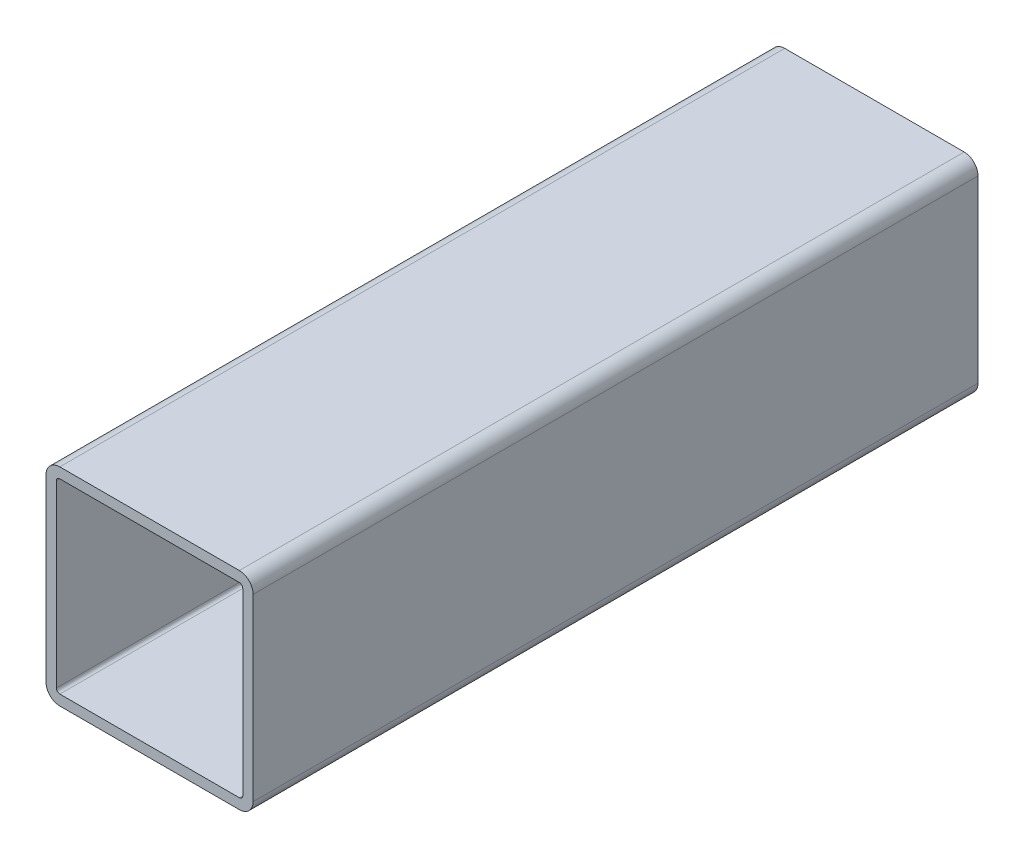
ISO-10303-21;
HEADER;
FILE_DESCRIPTION(('STEP AP214'),'2;1');
FILE_NAME('part.step','',(''),(''),'','','');
FILE_SCHEMA(('AUTOMOTIVE_DESIGN { 1 0 10303 214 1 1 1 1 }'));
ENDSEC;
DATA;
#1=APPLICATION_CONTEXT('core data for automotive mechanical design processes');
#2=APPLICATION_PROTOCOL_DEFINITION('international standard','automotive_design',2000,#1);
#3=PRODUCT_CONTEXT('',#1,'mechanical');
#4=PRODUCT('Part','Part','',(#3));
#5=PRODUCT_RELATED_PRODUCT_CATEGORY('part','',(#4));
#6=PRODUCT_DEFINITION_FORMATION('','',#4);
#7=PRODUCT_DEFINITION_CONTEXT('part definition',#1,'design');
#8=PRODUCT_DEFINITION('design','',#6,#7);
#9=PRODUCT_DEFINITION_SHAPE('','',#8);
#10=(LENGTH_UNIT() NAMED_UNIT(*) SI_UNIT(.MILLI.,.METRE.));
#11=(NAMED_UNIT(*) PLANE_ANGLE_UNIT() SI_UNIT($,.RADIAN.));
#12=(NAMED_UNIT(*) SI_UNIT($,.STERADIAN.) SOLID_ANGLE_UNIT());
#13=UNCERTAINTY_MEASURE_WITH_UNIT(LENGTH_MEASURE(1.E-05),#10,'distance_accuracy_value','');
#14=(GEOMETRIC_REPRESENTATION_CONTEXT(3) GLOBAL_UNCERTAINTY_ASSIGNED_CONTEXT((#13)) GLOBAL_UNIT_ASSIGNED_CONTEXT((#10,
#11,#12)) REPRESENTATION_CONTEXT('',''));
#15=CARTESIAN_POINT('',(0.,0.,0.));
#16=DIRECTION('',(0.,0.,1.));
#17=DIRECTION('',(1.,0.,0.));
#18=AXIS2_PLACEMENT_3D('',#15,#16,#17);
#19=CARTESIAN_POINT('',(56.,-56.,210.));
#20=DIRECTION('',(0.,0.,-1.));
#21=DIRECTION('',(-1.,0.,0.));
#22=AXIS2_PLACEMENT_3D('',#19,#20,#21);
#23=PLANE('',#22);
#24=CARTESIAN_POINT('',(56.,-56.,210.));
#25=DIRECTION('',(0.,0.,1.));
#26=DIRECTION('',(-1.,0.,0.));
#27=AXIS2_PLACEMENT_3D('',#24,#25,#26);
#28=CIRCLE('',#27,4.);
#29=CARTESIAN_POINT('',(56.,-60.,210.));
#30=VERTEX_POINT('',#29);
#31=CARTESIAN_POINT('',(60.,-56.,210.));
#32=VERTEX_POINT('',#31);
#33=EDGE_CURVE('E222',#30,#32,#28,.T.);
#34=ORIENTED_EDGE('',*,*,#33,.T.);
#35=DIRECTION('',(0.,1.,0.));
#36=VECTOR('',#35,1.);
#37=CARTESIAN_POINT('',(60.,-4.00000000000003,210.));
#38=LINE('',#37,#36);
#39=CARTESIAN_POINT('',(60.,-4.00000000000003,210.));
#40=VERTEX_POINT('',#39);
#41=EDGE_CURVE('E225',#32,#40,#38,.T.);
#42=ORIENTED_EDGE('',*,*,#41,.T.);
#43=CARTESIAN_POINT('',(56.,-4.,210.));
#44=DIRECTION('',(0.,0.,1.));
#45=DIRECTION('',(-1.,0.,0.));
#46=AXIS2_PLACEMENT_3D('',#43,#44,#45);
#47=CIRCLE('',#46,4.);
#48=CARTESIAN_POINT('',(56.,0.,210.));
#49=VERTEX_POINT('',#48);
#50=EDGE_CURVE('E227',#40,#49,#47,.T.);
#51=ORIENTED_EDGE('',*,*,#50,.T.);
#52=DIRECTION('',(-1.,0.,0.));
#53=VECTOR('',#52,1.);
#54=CARTESIAN_POINT('',(4.00000000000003,0.,210.));
#55=LINE('',#54,#53);
#56=CARTESIAN_POINT('',(4.00000000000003,0.,210.));
#57=VERTEX_POINT('',#56);
#58=EDGE_CURVE('E229',#49,#57,#55,.T.);
#59=ORIENTED_EDGE('',*,*,#58,.T.);
#60=CARTESIAN_POINT('',(4.,-4.,210.));
#61=DIRECTION('',(0.,0.,1.));
#62=DIRECTION('',(-1.,0.,0.));
#63=AXIS2_PLACEMENT_3D('',#60,#61,#62);
#64=CIRCLE('',#63,4.);
#65=CARTESIAN_POINT('',(0.,-4.00000000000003,210.));
#66=VERTEX_POINT('',#65);
#67=EDGE_CURVE('E231',#57,#66,#64,.T.);
#68=ORIENTED_EDGE('',*,*,#67,.T.);
#69=DIRECTION('',(0.,-1.,0.));
#70=VECTOR('',#69,1.);
#71=CARTESIAN_POINT('',(0.,-4.00000000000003,210.));
#72=LINE('',#71,#70);
#73=CARTESIAN_POINT('',(0.,-56.,210.));
#74=VERTEX_POINT('',#73);
#75=EDGE_CURVE('E233',#66,#74,#72,.T.);
#76=ORIENTED_EDGE('',*,*,#75,.T.);
#77=CARTESIAN_POINT('',(4.00000000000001,-56.,210.));
#78=DIRECTION('',(0.,0.,1.));
#79=DIRECTION('',(-1.,0.,0.));
#80=AXIS2_PLACEMENT_3D('',#77,#78,#79);
#81=CIRCLE('',#80,4.);
#82=CARTESIAN_POINT('',(4.00000000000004,-60.,210.));
#83=VERTEX_POINT('',#82);
#84=EDGE_CURVE('E235',#74,#83,#81,.T.);
#85=ORIENTED_EDGE('',*,*,#84,.T.);
#86=DIRECTION('',(1.,0.,0.));
#87=VECTOR('',#86,1.);
#88=CARTESIAN_POINT('',(4.00000000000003,-60.,210.));
#89=LINE('',#88,#87);
#90=EDGE_CURVE('E237',#83,#30,#89,.T.);
#91=ORIENTED_EDGE('',*,*,#90,.T.);
#92=EDGE_LOOP('',(#34,#42,#51,#59,#68,#76,#85,#91));
#93=FACE_BOUND('',#92,.T.);
#94=CARTESIAN_POINT('',(4.,-4.,210.));
#95=DIRECTION('',(0.,0.,1.));
#96=DIRECTION('',(-1.,0.,0.));
#97=AXIS2_PLACEMENT_3D('',#94,#95,#96);
#98=CIRCLE('',#97,0.999999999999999);
#99=CARTESIAN_POINT('',(4.00000000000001,-3.,210.));
#100=VERTEX_POINT('',#99);
#101=CARTESIAN_POINT('',(3.,-4.00000000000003,210.));
#102=VERTEX_POINT('',#101);
#103=EDGE_CURVE('E157',#100,#102,#98,.T.);
#104=ORIENTED_EDGE('',*,*,#103,.F.);
#105=DIRECTION('',(-1.,0.,0.));
#106=VECTOR('',#105,1.);
#107=CARTESIAN_POINT('',(4.00000000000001,-3.,210.));
#108=LINE('',#107,#106);
#109=CARTESIAN_POINT('',(56.,-3.,210.));
#110=VERTEX_POINT('',#109);
#111=EDGE_CURVE('E192',#110,#100,#108,.T.);
#112=ORIENTED_EDGE('',*,*,#111,.F.);
#113=CARTESIAN_POINT('',(56.,-4.,210.));
#114=DIRECTION('',(0.,0.,1.));
#115=DIRECTION('',(-1.,0.,0.));
#116=AXIS2_PLACEMENT_3D('',#113,#114,#115);
#117=CIRCLE('',#116,1.);
#118=CARTESIAN_POINT('',(57.,-4.00000000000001,210.));
#119=VERTEX_POINT('',#118);
#120=EDGE_CURVE('E190',#119,#110,#117,.T.);
#121=ORIENTED_EDGE('',*,*,#120,.F.);
#122=DIRECTION('',(0.,1.,0.));
#123=VECTOR('',#122,1.);
#124=CARTESIAN_POINT('',(57.,-4.00000000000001,210.));
#125=LINE('',#124,#123);
#126=CARTESIAN_POINT('',(57.,-56.,210.));
#127=VERTEX_POINT('',#126);
#128=EDGE_CURVE('E188',#127,#119,#125,.T.);
#129=ORIENTED_EDGE('',*,*,#128,.F.);
#130=CARTESIAN_POINT('',(56.,-56.,210.));
#131=DIRECTION('',(0.,0.,1.));
#132=DIRECTION('',(-1.,0.,0.));
#133=AXIS2_PLACEMENT_3D('',#130,#131,#132);
#134=CIRCLE('',#133,1.);
#135=CARTESIAN_POINT('',(56.,-57.,210.));
#136=VERTEX_POINT('',#135);
#137=EDGE_CURVE('E186',#136,#127,#134,.T.);
#138=ORIENTED_EDGE('',*,*,#137,.F.);
#139=DIRECTION('',(1.,0.,0.));
#140=VECTOR('',#139,1.);
#141=CARTESIAN_POINT('',(4.00000000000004,-57.,210.));
#142=LINE('',#141,#140);
#143=CARTESIAN_POINT('',(4.00000000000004,-57.,210.));
#144=VERTEX_POINT('',#143);
#145=EDGE_CURVE('E184',#144,#136,#142,.T.);
#146=ORIENTED_EDGE('',*,*,#145,.F.);
#147=CARTESIAN_POINT('',(4.00000000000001,-56.,210.));
#148=DIRECTION('',(0.,0.,1.));
#149=DIRECTION('',(-1.,0.,0.));
#150=AXIS2_PLACEMENT_3D('',#147,#148,#149);
#151=CIRCLE('',#150,1.);
#152=CARTESIAN_POINT('',(3.00000000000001,-56.,210.));
#153=VERTEX_POINT('',#152);
#154=EDGE_CURVE('E182',#153,#144,#151,.T.);
#155=ORIENTED_EDGE('',*,*,#154,.F.);
#156=DIRECTION('',(0.,-1.,0.));
#157=VECTOR('',#156,1.);
#158=CARTESIAN_POINT('',(3.,-4.00000000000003,210.));
#159=LINE('',#158,#157);
#160=EDGE_CURVE('E180',#102,#153,#159,.T.);
#161=ORIENTED_EDGE('',*,*,#160,.F.);
#162=EDGE_LOOP('',(#104,#112,#121,#129,#138,#146,#155,#161));
#163=FACE_BOUND('',#162,.T.);
#164=ADVANCED_FACE('F29',(#93,#163),#23,.F.);
#165=CARTESIAN_POINT('',(56.,-56.,0.));
#166=DIRECTION('',(0.,0.,-1.));
#167=DIRECTION('',(-1.,0.,0.));
#168=AXIS2_PLACEMENT_3D('',#165,#166,#167);
#169=PLANE('',#168);
#170=CARTESIAN_POINT('',(56.,-56.,0.));
#171=DIRECTION('',(0.,0.,1.));
#172=DIRECTION('',(-1.,0.,0.));
#173=AXIS2_PLACEMENT_3D('',#170,#171,#172);
#174=CIRCLE('',#173,4.);
#175=CARTESIAN_POINT('',(56.,-60.,0.));
#176=VERTEX_POINT('',#175);
#177=CARTESIAN_POINT('',(60.,-56.,0.));
#178=VERTEX_POINT('',#177);
#179=EDGE_CURVE('E158',#176,#178,#174,.T.);
#180=ORIENTED_EDGE('',*,*,#179,.F.);
#181=DIRECTION('',(1.,0.,0.));
#182=VECTOR('',#181,1.);
#183=CARTESIAN_POINT('',(4.00000000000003,-60.,0.));
#184=LINE('',#183,#182);
#185=CARTESIAN_POINT('',(4.00000000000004,-60.,0.));
#186=VERTEX_POINT('',#185);
#187=EDGE_CURVE('E220',#186,#176,#184,.T.);
#188=ORIENTED_EDGE('',*,*,#187,.F.);
#189=CARTESIAN_POINT('',(4.00000000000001,-56.,0.));
#190=DIRECTION('',(0.,0.,1.));
#191=DIRECTION('',(-1.,0.,0.));
#192=AXIS2_PLACEMENT_3D('',#189,#190,#191);
#193=CIRCLE('',#192,4.);
#194=CARTESIAN_POINT('',(0.,-56.,0.));
#195=VERTEX_POINT('',#194);
#196=EDGE_CURVE('E218',#195,#186,#193,.T.);
#197=ORIENTED_EDGE('',*,*,#196,.F.);
#198=DIRECTION('',(0.,-1.,0.));
#199=VECTOR('',#198,1.);
#200=CARTESIAN_POINT('',(0.,-4.00000000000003,0.));
#201=LINE('',#200,#199);
#202=CARTESIAN_POINT('',(0.,-4.00000000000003,0.));
#203=VERTEX_POINT('',#202);
#204=EDGE_CURVE('E216',#203,#195,#201,.T.);
#205=ORIENTED_EDGE('',*,*,#204,.F.);
#206=CARTESIAN_POINT('',(4.,-4.,0.));
#207=DIRECTION('',(0.,0.,1.));
#208=DIRECTION('',(-1.,0.,0.));
#209=AXIS2_PLACEMENT_3D('',#206,#207,#208);
#210=CIRCLE('',#209,4.);
#211=CARTESIAN_POINT('',(4.00000000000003,0.,0.));
#212=VERTEX_POINT('',#211);
#213=EDGE_CURVE('E214',#212,#203,#210,.T.);
#214=ORIENTED_EDGE('',*,*,#213,.F.);
#215=DIRECTION('',(-1.,0.,0.));
#216=VECTOR('',#215,1.);
#217=CARTESIAN_POINT('',(4.00000000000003,0.,0.));
#218=LINE('',#217,#216);
#219=CARTESIAN_POINT('',(56.,0.,0.));
#220=VERTEX_POINT('',#219);
#221=EDGE_CURVE('E212',#220,#212,#218,.T.);
#222=ORIENTED_EDGE('',*,*,#221,.F.);
#223=CARTESIAN_POINT('',(56.,-4.,0.));
#224=DIRECTION('',(0.,0.,1.));
#225=DIRECTION('',(-1.,0.,0.));
#226=AXIS2_PLACEMENT_3D('',#223,#224,#225);
#227=CIRCLE('',#226,4.);
#228=CARTESIAN_POINT('',(60.,-4.00000000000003,0.));
#229=VERTEX_POINT('',#228);
#230=EDGE_CURVE('E210',#229,#220,#227,.T.);
#231=ORIENTED_EDGE('',*,*,#230,.F.);
#232=DIRECTION('',(0.,1.,0.));
#233=VECTOR('',#232,1.);
#234=CARTESIAN_POINT('',(60.,-4.00000000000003,0.));
#235=LINE('',#234,#233);
#236=EDGE_CURVE('E208',#178,#229,#235,.T.);
#237=ORIENTED_EDGE('',*,*,#236,.F.);
#238=EDGE_LOOP('',(#180,#188,#197,#205,#214,#222,#231,#237));
#239=FACE_BOUND('',#238,.T.);
#240=DIRECTION('',(-1.,0.,0.));
#241=VECTOR('',#240,1.);
#242=CARTESIAN_POINT('',(4.00000000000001,-3.,0.));
#243=LINE('',#242,#241);
#244=CARTESIAN_POINT('',(56.,-3.,0.));
#245=VERTEX_POINT('',#244);
#246=CARTESIAN_POINT('',(4.00000000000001,-3.,0.));
#247=VERTEX_POINT('',#246);
#248=EDGE_CURVE('E163',#245,#247,#243,.T.);
#249=ORIENTED_EDGE('',*,*,#248,.T.);
#250=CARTESIAN_POINT('',(4.,-4.,0.));
#251=DIRECTION('',(0.,0.,1.));
#252=DIRECTION('',(-1.,0.,0.));
#253=AXIS2_PLACEMENT_3D('',#250,#251,#252);
#254=CIRCLE('',#253,0.999999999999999);
#255=CARTESIAN_POINT('',(3.,-4.00000000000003,0.));
#256=VERTEX_POINT('',#255);
#257=EDGE_CURVE('E52',#247,#256,#254,.T.);
#258=ORIENTED_EDGE('',*,*,#257,.T.);
#259=DIRECTION('',(0.,-1.,0.));
#260=VECTOR('',#259,1.);
#261=CARTESIAN_POINT('',(3.,-4.00000000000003,0.));
#262=LINE('',#261,#260);
#263=CARTESIAN_POINT('',(3.00000000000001,-56.,0.));
#264=VERTEX_POINT('',#263);
#265=EDGE_CURVE('E144',#256,#264,#262,.T.);
#266=ORIENTED_EDGE('',*,*,#265,.T.);
#267=CARTESIAN_POINT('',(4.00000000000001,-56.,0.));
#268=DIRECTION('',(0.,0.,1.));
#269=DIRECTION('',(-1.,0.,0.));
#270=AXIS2_PLACEMENT_3D('',#267,#268,#269);
#271=CIRCLE('',#270,1.);
#272=CARTESIAN_POINT('',(4.00000000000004,-57.,0.));
#273=VERTEX_POINT('',#272);
#274=EDGE_CURVE('E153',#264,#273,#271,.T.);
#275=ORIENTED_EDGE('',*,*,#274,.T.);
#276=DIRECTION('',(1.,0.,0.));
#277=VECTOR('',#276,1.);
#278=CARTESIAN_POINT('',(4.00000000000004,-57.,0.));
#279=LINE('',#278,#277);
#280=CARTESIAN_POINT('',(56.,-57.,0.));
#281=VERTEX_POINT('',#280);
#282=EDGE_CURVE('E167',#273,#281,#279,.T.);
#283=ORIENTED_EDGE('',*,*,#282,.T.);
#284=CARTESIAN_POINT('',(56.,-56.,0.));
#285=DIRECTION('',(0.,0.,1.));
#286=DIRECTION('',(-1.,0.,0.));
#287=AXIS2_PLACEMENT_3D('',#284,#285,#286);
#288=CIRCLE('',#287,1.);
#289=CARTESIAN_POINT('',(57.,-56.,0.));
#290=VERTEX_POINT('',#289);
#291=EDGE_CURVE('E170',#281,#290,#288,.T.);
#292=ORIENTED_EDGE('',*,*,#291,.T.);
#293=DIRECTION('',(0.,1.,0.));
#294=VECTOR('',#293,1.);
#295=CARTESIAN_POINT('',(57.,-4.00000000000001,0.));
#296=LINE('',#295,#294);
#297=CARTESIAN_POINT('',(57.,-4.00000000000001,0.));
#298=VERTEX_POINT('',#297);
#299=EDGE_CURVE('E173',#290,#298,#296,.T.);
#300=ORIENTED_EDGE('',*,*,#299,.T.);
#301=CARTESIAN_POINT('',(56.,-4.,0.));
#302=DIRECTION('',(0.,0.,1.));
#303=DIRECTION('',(-1.,0.,0.));
#304=AXIS2_PLACEMENT_3D('',#301,#302,#303);
#305=CIRCLE('',#304,1.);
#306=EDGE_CURVE('E176',#298,#245,#305,.T.);
#307=ORIENTED_EDGE('',*,*,#306,.T.);
#308=EDGE_LOOP('',(#249,#258,#266,#275,#283,#292,#300,#307));
#309=FACE_BOUND('',#308,.T.);
#310=ADVANCED_FACE('F161',(#239,#309),#169,.T.);
#311=CARTESIAN_POINT('',(56.,-56.,210.));
#312=DIRECTION('',(0.,0.,-1.));
#313=DIRECTION('',(-1.,0.,0.));
#314=AXIS2_PLACEMENT_3D('',#311,#312,#313);
#315=CYLINDRICAL_SURFACE('',#314,4.);
#316=ORIENTED_EDGE('',*,*,#179,.T.);
#317=DIRECTION('',(0.,0.,-1.));
#318=VECTOR('',#317,1.);
#319=CARTESIAN_POINT('',(60.,-56.,210.));
#320=LINE('',#319,#318);
#321=EDGE_CURVE('E11',#32,#178,#320,.T.);
#322=ORIENTED_EDGE('',*,*,#321,.F.);
#323=ORIENTED_EDGE('',*,*,#33,.F.);
#324=DIRECTION('',(0.,0.,-1.));
#325=VECTOR('',#324,1.);
#326=CARTESIAN_POINT('',(56.,-60.,210.));
#327=LINE('',#326,#325);
#328=EDGE_CURVE('E239',#30,#176,#327,.T.);
#329=ORIENTED_EDGE('',*,*,#328,.T.);
#330=EDGE_LOOP('',(#316,#322,#323,#329));
#331=FACE_BOUND('',#330,.T.);
#332=ADVANCED_FACE('F31',(#331),#315,.T.);
#333=CARTESIAN_POINT('',(60.,-4.00000000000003,210.));
#334=DIRECTION('',(-1.,0.,0.));
#335=DIRECTION('',(0.,-1.,0.));
#336=AXIS2_PLACEMENT_3D('',#333,#334,#335);
#337=PLANE('',#336);
#338=ORIENTED_EDGE('',*,*,#236,.T.);
#339=DIRECTION('',(0.,0.,-1.));
#340=VECTOR('',#339,1.);
#341=CARTESIAN_POINT('',(60.,-4.00000000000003,210.));
#342=LINE('',#341,#340);
#343=EDGE_CURVE('E37',#40,#229,#342,.T.);
#344=ORIENTED_EDGE('',*,*,#343,.F.);
#345=ORIENTED_EDGE('',*,*,#41,.F.);
#346=ORIENTED_EDGE('',*,*,#321,.T.);
#347=EDGE_LOOP('',(#338,#344,#345,#346));
#348=FACE_BOUND('',#347,.T.);
#349=ADVANCED_FACE('F283',(#348),#337,.F.);
#350=CARTESIAN_POINT('',(56.,-4.,210.));
#351=DIRECTION('',(0.,0.,-1.));
#352=DIRECTION('',(-1.,0.,0.));
#353=AXIS2_PLACEMENT_3D('',#350,#351,#352);
#354=CYLINDRICAL_SURFACE('',#353,4.);
#355=ORIENTED_EDGE('',*,*,#230,.T.);
#356=DIRECTION('',(0.,0.,-1.));
#357=VECTOR('',#356,1.);
#358=CARTESIAN_POINT('',(56.,0.,210.));
#359=LINE('',#358,#357);
#360=EDGE_CURVE('E254',#49,#220,#359,.T.);
#361=ORIENTED_EDGE('',*,*,#360,.F.);
#362=ORIENTED_EDGE('',*,*,#50,.F.);
#363=ORIENTED_EDGE('',*,*,#343,.T.);
#364=EDGE_LOOP('',(#355,#361,#362,#363));
#365=FACE_BOUND('',#364,.T.);
#366=ADVANCED_FACE('F261',(#365),#354,.T.);
#367=CARTESIAN_POINT('',(4.00000000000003,0.,210.));
#368=DIRECTION('',(0.,-1.,0.));
#369=DIRECTION('',(0.,0.,-1.));
#370=AXIS2_PLACEMENT_3D('',#367,#368,#369);
#371=PLANE('',#370);
#372=ORIENTED_EDGE('',*,*,#221,.T.);
#373=DIRECTION('',(0.,0.,-1.));
#374=VECTOR('',#373,1.);
#375=CARTESIAN_POINT('',(4.00000000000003,0.,210.));
#376=LINE('',#375,#374);
#377=EDGE_CURVE('E251',#57,#212,#376,.T.);
#378=ORIENTED_EDGE('',*,*,#377,.F.);
#379=ORIENTED_EDGE('',*,*,#58,.F.);
#380=ORIENTED_EDGE('',*,*,#360,.T.);
#381=EDGE_LOOP('',(#372,#378,#379,#380));
#382=FACE_BOUND('',#381,.T.);
#383=ADVANCED_FACE('F271',(#382),#371,.F.);
#384=CARTESIAN_POINT('',(4.,-4.,210.));
#385=DIRECTION('',(0.,0.,-1.));
#386=DIRECTION('',(-1.,0.,0.));
#387=AXIS2_PLACEMENT_3D('',#384,#385,#386);
#388=CYLINDRICAL_SURFACE('',#387,4.);
#389=ORIENTED_EDGE('',*,*,#213,.T.);
#390=DIRECTION('',(0.,0.,-1.));
#391=VECTOR('',#390,1.);
#392=CARTESIAN_POINT('',(0.,-4.00000000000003,210.));
#393=LINE('',#392,#391);
#394=EDGE_CURVE('E248',#66,#203,#393,.T.);
#395=ORIENTED_EDGE('',*,*,#394,.F.);
#396=ORIENTED_EDGE('',*,*,#67,.F.);
#397=ORIENTED_EDGE('',*,*,#377,.T.);
#398=EDGE_LOOP('',(#389,#395,#396,#397));
#399=FACE_BOUND('',#398,.T.);
#400=ADVANCED_FACE('F275',(#399),#388,.T.);
#401=CARTESIAN_POINT('',(0.,-4.00000000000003,210.));
#402=DIRECTION('',(1.,0.,0.));
#403=DIRECTION('',(0.,1.,0.));
#404=AXIS2_PLACEMENT_3D('',#401,#402,#403);
#405=PLANE('',#404);
#406=ORIENTED_EDGE('',*,*,#204,.T.);
#407=DIRECTION('',(0.,0.,-1.));
#408=VECTOR('',#407,1.);
#409=CARTESIAN_POINT('',(0.,-56.,210.));
#410=LINE('',#409,#408);
#411=EDGE_CURVE('E245',#74,#195,#410,.T.);
#412=ORIENTED_EDGE('',*,*,#411,.F.);
#413=ORIENTED_EDGE('',*,*,#75,.F.);
#414=ORIENTED_EDGE('',*,*,#394,.T.);
#415=EDGE_LOOP('',(#406,#412,#413,#414));
#416=FACE_BOUND('',#415,.T.);
#417=ADVANCED_FACE('F296',(#416),#405,.F.);
#418=CARTESIAN_POINT('',(4.00000000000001,-56.,210.));
#419=DIRECTION('',(0.,0.,-1.));
#420=DIRECTION('',(-1.,0.,0.));
#421=AXIS2_PLACEMENT_3D('',#418,#419,#420);
#422=CYLINDRICAL_SURFACE('',#421,4.);
#423=ORIENTED_EDGE('',*,*,#196,.T.);
#424=DIRECTION('',(0.,0.,-1.));
#425=VECTOR('',#424,1.);
#426=CARTESIAN_POINT('',(4.00000000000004,-60.,210.));
#427=LINE('',#426,#425);
#428=EDGE_CURVE('E242',#83,#186,#427,.T.);
#429=ORIENTED_EDGE('',*,*,#428,.F.);
#430=ORIENTED_EDGE('',*,*,#84,.F.);
#431=ORIENTED_EDGE('',*,*,#411,.T.);
#432=EDGE_LOOP('',(#423,#429,#430,#431));
#433=FACE_BOUND('',#432,.T.);
#434=ADVANCED_FACE('F294',(#433),#422,.T.);
#435=CARTESIAN_POINT('',(4.00000000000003,-60.,210.));
#436=DIRECTION('',(0.,1.,0.));
#437=DIRECTION('',(0.,0.,1.));
#438=AXIS2_PLACEMENT_3D('',#435,#436,#437);
#439=PLANE('',#438);
#440=ORIENTED_EDGE('',*,*,#187,.T.);
#441=ORIENTED_EDGE('',*,*,#328,.F.);
#442=ORIENTED_EDGE('',*,*,#90,.F.);
#443=ORIENTED_EDGE('',*,*,#428,.T.);
#444=EDGE_LOOP('',(#440,#441,#442,#443));
#445=FACE_BOUND('',#444,.T.);
#446=ADVANCED_FACE('F289',(#445),#439,.F.);
#447=CARTESIAN_POINT('',(4.,-4.,210.));
#448=DIRECTION('',(0.,0.,-1.));
#449=DIRECTION('',(-1.,0.,0.));
#450=AXIS2_PLACEMENT_3D('',#447,#448,#449);
#451=CYLINDRICAL_SURFACE('',#450,0.999999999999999);
#452=ORIENTED_EDGE('',*,*,#257,.F.);
#453=DIRECTION('',(0.,0.,-1.));
#454=VECTOR('',#453,1.);
#455=CARTESIAN_POINT('',(4.00000000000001,-3.,210.));
#456=LINE('',#455,#454);
#457=EDGE_CURVE('E194',#100,#247,#456,.T.);
#458=ORIENTED_EDGE('',*,*,#457,.F.);
#459=ORIENTED_EDGE('',*,*,#103,.T.);
#460=DIRECTION('',(0.,0.,-1.));
#461=VECTOR('',#460,1.);
#462=CARTESIAN_POINT('',(3.,-4.00000000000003,210.));
#463=LINE('',#462,#461);
#464=EDGE_CURVE('E146',#102,#256,#463,.T.);
#465=ORIENTED_EDGE('',*,*,#464,.T.);
#466=EDGE_LOOP('',(#452,#458,#459,#465));
#467=FACE_BOUND('',#466,.T.);
#468=ADVANCED_FACE('F155',(#467),#451,.F.);
#469=CARTESIAN_POINT('',(3.,-4.00000000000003,210.));
#470=DIRECTION('',(1.,0.,0.));
#471=DIRECTION('',(0.,1.,0.));
#472=AXIS2_PLACEMENT_3D('',#469,#470,#471);
#473=PLANE('',#472);
#474=ORIENTED_EDGE('',*,*,#265,.F.);
#475=ORIENTED_EDGE('',*,*,#464,.F.);
#476=ORIENTED_EDGE('',*,*,#160,.T.);
#477=DIRECTION('',(0.,0.,-1.));
#478=VECTOR('',#477,1.);
#479=CARTESIAN_POINT('',(3.00000000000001,-56.,210.));
#480=LINE('',#479,#478);
#481=EDGE_CURVE('E149',#153,#264,#480,.T.);
#482=ORIENTED_EDGE('',*,*,#481,.T.);
#483=EDGE_LOOP('',(#474,#475,#476,#482));
#484=FACE_BOUND('',#483,.T.);
#485=ADVANCED_FACE('F145',(#484),#473,.T.);
#486=CARTESIAN_POINT('',(4.00000000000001,-56.,210.));
#487=DIRECTION('',(0.,0.,-1.));
#488=DIRECTION('',(-1.,0.,0.));
#489=AXIS2_PLACEMENT_3D('',#486,#487,#488);
#490=CYLINDRICAL_SURFACE('',#489,1.);
#491=ORIENTED_EDGE('',*,*,#274,.F.);
#492=ORIENTED_EDGE('',*,*,#481,.F.);
#493=ORIENTED_EDGE('',*,*,#154,.T.);
#494=DIRECTION('',(0.,0.,-1.));
#495=VECTOR('',#494,1.);
#496=CARTESIAN_POINT('',(4.00000000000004,-57.,210.));
#497=LINE('',#496,#495);
#498=EDGE_CURVE('E203',#144,#273,#497,.T.);
#499=ORIENTED_EDGE('',*,*,#498,.T.);
#500=EDGE_LOOP('',(#491,#492,#493,#499));
#501=FACE_BOUND('',#500,.T.);
#502=ADVANCED_FACE('F320',(#501),#490,.F.);
#503=CARTESIAN_POINT('',(4.00000000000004,-57.,210.));
#504=DIRECTION('',(0.,1.,0.));
#505=DIRECTION('',(0.,0.,1.));
#506=AXIS2_PLACEMENT_3D('',#503,#504,#505);
#507=PLANE('',#506);
#508=ORIENTED_EDGE('',*,*,#282,.F.);
#509=ORIENTED_EDGE('',*,*,#498,.F.);
#510=ORIENTED_EDGE('',*,*,#145,.T.);
#511=DIRECTION('',(0.,0.,-1.));
#512=VECTOR('',#511,1.);
#513=CARTESIAN_POINT('',(56.,-57.,210.));
#514=LINE('',#513,#512);
#515=EDGE_CURVE('E201',#136,#281,#514,.T.);
#516=ORIENTED_EDGE('',*,*,#515,.T.);
#517=EDGE_LOOP('',(#508,#509,#510,#516));
#518=FACE_BOUND('',#517,.T.);
#519=ADVANCED_FACE('F325',(#518),#507,.T.);
#520=CARTESIAN_POINT('',(56.,-56.,210.));
#521=DIRECTION('',(0.,0.,-1.));
#522=DIRECTION('',(-1.,0.,0.));
#523=AXIS2_PLACEMENT_3D('',#520,#521,#522);
#524=CYLINDRICAL_SURFACE('',#523,1.);
#525=ORIENTED_EDGE('',*,*,#291,.F.);
#526=ORIENTED_EDGE('',*,*,#515,.F.);
#527=ORIENTED_EDGE('',*,*,#137,.T.);
#528=DIRECTION('',(0.,0.,-1.));
#529=VECTOR('',#528,1.);
#530=CARTESIAN_POINT('',(57.,-56.,210.));
#531=LINE('',#530,#529);
#532=EDGE_CURVE('E199',#127,#290,#531,.T.);
#533=ORIENTED_EDGE('',*,*,#532,.T.);
#534=EDGE_LOOP('',(#525,#526,#527,#533));
#535=FACE_BOUND('',#534,.T.);
#536=ADVANCED_FACE('F329',(#535),#524,.F.);
#537=CARTESIAN_POINT('',(57.,-4.00000000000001,210.));
#538=DIRECTION('',(-1.,0.,0.));
#539=DIRECTION('',(0.,-1.,0.));
#540=AXIS2_PLACEMENT_3D('',#537,#538,#539);
#541=PLANE('',#540);
#542=ORIENTED_EDGE('',*,*,#299,.F.);
#543=ORIENTED_EDGE('',*,*,#532,.F.);
#544=ORIENTED_EDGE('',*,*,#128,.T.);
#545=DIRECTION('',(0.,0.,-1.));
#546=VECTOR('',#545,1.);
#547=CARTESIAN_POINT('',(57.,-4.00000000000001,210.));
#548=LINE('',#547,#546);
#549=EDGE_CURVE('E197',#119,#298,#548,.T.);
#550=ORIENTED_EDGE('',*,*,#549,.T.);
#551=EDGE_LOOP('',(#542,#543,#544,#550));
#552=FACE_BOUND('',#551,.T.);
#553=ADVANCED_FACE('F333',(#552),#541,.T.);
#554=CARTESIAN_POINT('',(56.,-4.,210.));
#555=DIRECTION('',(0.,0.,-1.));
#556=DIRECTION('',(-1.,0.,0.));
#557=AXIS2_PLACEMENT_3D('',#554,#555,#556);
#558=CYLINDRICAL_SURFACE('',#557,1.);
#559=ORIENTED_EDGE('',*,*,#306,.F.);
#560=ORIENTED_EDGE('',*,*,#549,.F.);
#561=ORIENTED_EDGE('',*,*,#120,.T.);
#562=DIRECTION('',(0.,0.,-1.));
#563=VECTOR('',#562,1.);
#564=CARTESIAN_POINT('',(56.,-3.,210.));
#565=LINE('',#564,#563);
#566=EDGE_CURVE('E44',#110,#245,#565,.T.);
#567=ORIENTED_EDGE('',*,*,#566,.T.);
#568=EDGE_LOOP('',(#559,#560,#561,#567));
#569=FACE_BOUND('',#568,.T.);
#570=ADVANCED_FACE('F337',(#569),#558,.F.);
#571=CARTESIAN_POINT('',(4.00000000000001,-3.,210.));
#572=DIRECTION('',(0.,-1.,0.));
#573=DIRECTION('',(0.,0.,-1.));
#574=AXIS2_PLACEMENT_3D('',#571,#572,#573);
#575=PLANE('',#574);
#576=ORIENTED_EDGE('',*,*,#248,.F.);
#577=ORIENTED_EDGE('',*,*,#566,.F.);
#578=ORIENTED_EDGE('',*,*,#111,.T.);
#579=ORIENTED_EDGE('',*,*,#457,.T.);
#580=EDGE_LOOP('',(#576,#577,#578,#579));
#581=FACE_BOUND('',#580,.T.);
#582=ADVANCED_FACE('F341',(#581),#575,.T.);
#583=CLOSED_SHELL('',(#164,#310,#332,#349,#366,#383,#400,#417,#434,#446,#468,#485,#502,#519,
#536,#553,#570,#582));
#584=MANIFOLD_SOLID_BREP('B2',#583);
#585=ADVANCED_BREP_SHAPE_REPRESENTATION('',(#18,#584),#14);
#586=SHAPE_DEFINITION_REPRESENTATION(#9,#585);
ENDSEC;
END-ISO-10303-21;
